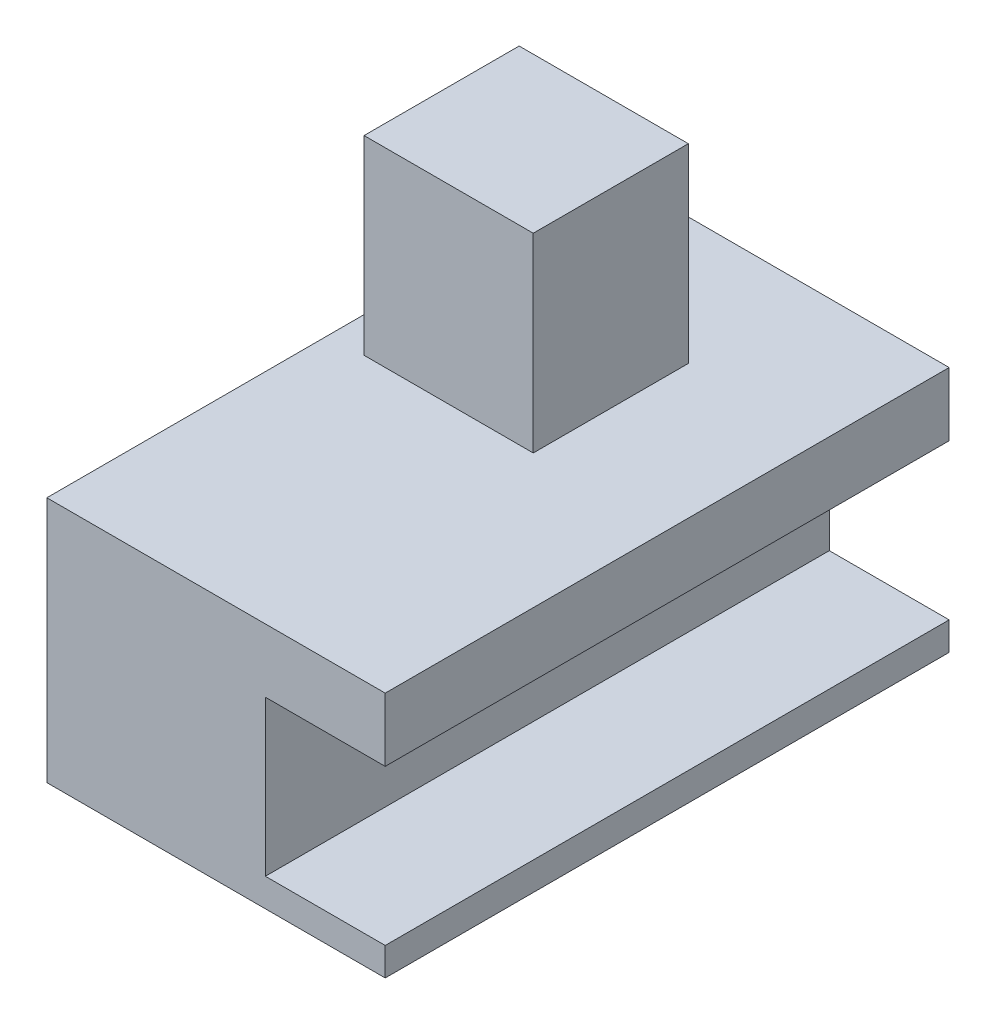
ISO-10303-21;
HEADER;
FILE_DESCRIPTION(('STEP AP214'),'2;1');
FILE_NAME('part.step','',(''),(''),'','','');
FILE_SCHEMA(('AUTOMOTIVE_DESIGN { 1 0 10303 214 1 1 1 1 }'));
ENDSEC;
DATA;
#1=APPLICATION_CONTEXT('core data for automotive mechanical design processes');
#2=APPLICATION_PROTOCOL_DEFINITION('international standard','automotive_design',2000,#1);
#3=PRODUCT_CONTEXT('',#1,'mechanical');
#4=PRODUCT('Part','Part','',(#3));
#5=PRODUCT_RELATED_PRODUCT_CATEGORY('part','',(#4));
#6=PRODUCT_DEFINITION_FORMATION('','',#4);
#7=PRODUCT_DEFINITION_CONTEXT('part definition',#1,'design');
#8=PRODUCT_DEFINITION('design','',#6,#7);
#9=PRODUCT_DEFINITION_SHAPE('','',#8);
#10=(LENGTH_UNIT() NAMED_UNIT(*) SI_UNIT(.MILLI.,.METRE.));
#11=(NAMED_UNIT(*) PLANE_ANGLE_UNIT() SI_UNIT($,.RADIAN.));
#12=(NAMED_UNIT(*) SI_UNIT($,.STERADIAN.) SOLID_ANGLE_UNIT());
#13=UNCERTAINTY_MEASURE_WITH_UNIT(LENGTH_MEASURE(1.E-05),#10,'distance_accuracy_value','');
#14=(GEOMETRIC_REPRESENTATION_CONTEXT(3) GLOBAL_UNCERTAINTY_ASSIGNED_CONTEXT((#13)) GLOBAL_UNIT_ASSIGNED_CONTEXT((#10,
#11,#12)) REPRESENTATION_CONTEXT('',''));
#15=CARTESIAN_POINT('',(0.,0.,0.));
#16=DIRECTION('',(0.,0.,1.));
#17=DIRECTION('',(1.,0.,0.));
#18=AXIS2_PLACEMENT_3D('',#15,#16,#17);
#19=CARTESIAN_POINT('',(0.,35.,-80.));
#20=DIRECTION('',(0.,1.,0.));
#21=DIRECTION('',(0.,0.,1.));
#22=AXIS2_PLACEMENT_3D('',#19,#20,#21);
#23=PLANE('',#22);
#24=DIRECTION('',(-1.,0.,0.));
#25=VECTOR('',#24,1.);
#26=CARTESIAN_POINT('',(0.,35.,0.));
#27=LINE('',#26,#25);
#28=CARTESIAN_POINT('',(48.,35.,0.));
#29=VERTEX_POINT('',#28);
#30=CARTESIAN_POINT('',(0.,35.,0.));
#31=VERTEX_POINT('',#30);
#32=EDGE_CURVE('E174',#29,#31,#27,.T.);
#33=ORIENTED_EDGE('',*,*,#32,.F.);
#34=DIRECTION('',(0.,0.,1.));
#35=VECTOR('',#34,1.);
#36=CARTESIAN_POINT('',(48.,35.,-80.));
#37=LINE('',#36,#35);
#38=CARTESIAN_POINT('',(48.,35.,-80.));
#39=VERTEX_POINT('',#38);
#40=EDGE_CURVE('E33',#39,#29,#37,.T.);
#41=ORIENTED_EDGE('',*,*,#40,.F.);
#42=DIRECTION('',(-1.,0.,0.));
#43=VECTOR('',#42,1.);
#44=CARTESIAN_POINT('',(0.,35.,-80.));
#45=LINE('',#44,#43);
#46=CARTESIAN_POINT('',(0.,35.,-80.));
#47=VERTEX_POINT('',#46);
#48=EDGE_CURVE('E197',#39,#47,#45,.T.);
#49=ORIENTED_EDGE('',*,*,#48,.T.);
#50=DIRECTION('',(0.,0.,1.));
#51=VECTOR('',#50,1.);
#52=CARTESIAN_POINT('',(0.,35.,-80.));
#53=LINE('',#52,#51);
#54=EDGE_CURVE('E11',#47,#31,#53,.T.);
#55=ORIENTED_EDGE('',*,*,#54,.T.);
#56=EDGE_LOOP('',(#33,#41,#49,#55));
#57=FACE_BOUND('',#56,.T.);
#58=DIRECTION('',(-1.,0.,0.));
#59=VECTOR('',#58,1.);
#60=CARTESIAN_POINT('',(29.,35.,-62.));
#61=LINE('',#60,#59);
#62=CARTESIAN_POINT('',(29.,35.,-62.));
#63=VERTEX_POINT('',#62);
#64=CARTESIAN_POINT('',(5.,35.,-62.));
#65=VERTEX_POINT('',#64);
#66=EDGE_CURVE('E119',#63,#65,#61,.T.);
#67=ORIENTED_EDGE('',*,*,#66,.F.);
#68=DIRECTION('',(0.,0.,-1.));
#69=VECTOR('',#68,1.);
#70=CARTESIAN_POINT('',(29.,35.,-62.));
#71=LINE('',#70,#69);
#72=CARTESIAN_POINT('',(29.,35.,-40.));
#73=VERTEX_POINT('',#72);
#74=EDGE_CURVE('E130',#73,#63,#71,.T.);
#75=ORIENTED_EDGE('',*,*,#74,.F.);
#76=DIRECTION('',(1.,0.,0.));
#77=VECTOR('',#76,1.);
#78=CARTESIAN_POINT('',(29.,35.,-40.));
#79=LINE('',#78,#77);
#80=CARTESIAN_POINT('',(5.,35.,-40.));
#81=VERTEX_POINT('',#80);
#82=EDGE_CURVE('E140',#81,#73,#79,.T.);
#83=ORIENTED_EDGE('',*,*,#82,.F.);
#84=DIRECTION('',(0.,0.,1.));
#85=VECTOR('',#84,1.);
#86=CARTESIAN_POINT('',(5.,35.,-62.));
#87=LINE('',#86,#85);
#88=EDGE_CURVE('E138',#65,#81,#87,.T.);
#89=ORIENTED_EDGE('',*,*,#88,.F.);
#90=EDGE_LOOP('',(#67,#75,#83,#89));
#91=FACE_BOUND('',#90,.T.);
#92=ADVANCED_FACE('F24',(#57,#91),#23,.T.);
#93=CARTESIAN_POINT('',(0.,0.,-80.));
#94=DIRECTION('',(-1.,0.,0.));
#95=DIRECTION('',(0.,0.,1.));
#96=AXIS2_PLACEMENT_3D('',#93,#94,#95);
#97=PLANE('',#96);
#98=DIRECTION('',(0.,-1.,0.));
#99=VECTOR('',#98,1.);
#100=CARTESIAN_POINT('',(0.,0.,0.));
#101=LINE('',#100,#99);
#102=CARTESIAN_POINT('',(0.,0.,0.));
#103=VERTEX_POINT('',#102);
#104=EDGE_CURVE('E125',#31,#103,#101,.T.);
#105=ORIENTED_EDGE('',*,*,#104,.F.);
#106=ORIENTED_EDGE('',*,*,#54,.F.);
#107=DIRECTION('',(0.,-1.,0.));
#108=VECTOR('',#107,1.);
#109=CARTESIAN_POINT('',(0.,0.,-80.));
#110=LINE('',#109,#108);
#111=CARTESIAN_POINT('',(0.,0.,-80.));
#112=VERTEX_POINT('',#111);
#113=EDGE_CURVE('E177',#47,#112,#110,.T.);
#114=ORIENTED_EDGE('',*,*,#113,.T.);
#115=DIRECTION('',(0.,0.,1.));
#116=VECTOR('',#115,1.);
#117=CARTESIAN_POINT('',(0.,0.,-80.));
#118=LINE('',#117,#116);
#119=EDGE_CURVE('E28',#112,#103,#118,.T.);
#120=ORIENTED_EDGE('',*,*,#119,.T.);
#121=EDGE_LOOP('',(#105,#106,#114,#120));
#122=FACE_BOUND('',#121,.T.);
#123=ADVANCED_FACE('F26',(#122),#97,.T.);
#124=CARTESIAN_POINT('',(48.,26.,-80.));
#125=DIRECTION('',(1.,0.,0.));
#126=DIRECTION('',(0.,0.,-1.));
#127=AXIS2_PLACEMENT_3D('',#124,#125,#126);
#128=PLANE('',#127);
#129=DIRECTION('',(0.,1.,0.));
#130=VECTOR('',#129,1.);
#131=CARTESIAN_POINT('',(48.,26.,0.));
#132=LINE('',#131,#130);
#133=CARTESIAN_POINT('',(48.,26.,0.));
#134=VERTEX_POINT('',#133);
#135=EDGE_CURVE('E171',#134,#29,#132,.T.);
#136=ORIENTED_EDGE('',*,*,#135,.F.);
#137=DIRECTION('',(0.,0.,1.));
#138=VECTOR('',#137,1.);
#139=CARTESIAN_POINT('',(48.,26.,-80.));
#140=LINE('',#139,#138);
#141=CARTESIAN_POINT('',(48.,26.,-80.));
#142=VERTEX_POINT('',#141);
#143=EDGE_CURVE('E201',#142,#134,#140,.T.);
#144=ORIENTED_EDGE('',*,*,#143,.F.);
#145=DIRECTION('',(0.,1.,0.));
#146=VECTOR('',#145,1.);
#147=CARTESIAN_POINT('',(48.,26.,-80.));
#148=LINE('',#147,#146);
#149=EDGE_CURVE('E194',#142,#39,#148,.T.);
#150=ORIENTED_EDGE('',*,*,#149,.T.);
#151=ORIENTED_EDGE('',*,*,#40,.T.);
#152=EDGE_LOOP('',(#136,#144,#150,#151));
#153=FACE_BOUND('',#152,.T.);
#154=ADVANCED_FACE('F239',(#153),#128,.T.);
#155=CARTESIAN_POINT('',(48.,26.,-80.));
#156=DIRECTION('',(0.,-1.,0.));
#157=DIRECTION('',(1.,0.,0.));
#158=AXIS2_PLACEMENT_3D('',#155,#156,#157);
#159=PLANE('',#158);
#160=DIRECTION('',(1.,0.,0.));
#161=VECTOR('',#160,1.);
#162=CARTESIAN_POINT('',(48.,26.,0.));
#163=LINE('',#162,#161);
#164=CARTESIAN_POINT('',(31.,26.,0.));
#165=VERTEX_POINT('',#164);
#166=EDGE_CURVE('E168',#165,#134,#163,.T.);
#167=ORIENTED_EDGE('',*,*,#166,.F.);
#168=DIRECTION('',(0.,0.,1.));
#169=VECTOR('',#168,1.);
#170=CARTESIAN_POINT('',(31.,26.,-80.));
#171=LINE('',#170,#169);
#172=CARTESIAN_POINT('',(31.,26.,-80.));
#173=VERTEX_POINT('',#172);
#174=EDGE_CURVE('E203',#173,#165,#171,.T.);
#175=ORIENTED_EDGE('',*,*,#174,.F.);
#176=DIRECTION('',(1.,0.,0.));
#177=VECTOR('',#176,1.);
#178=CARTESIAN_POINT('',(48.,26.,-80.));
#179=LINE('',#178,#177);
#180=EDGE_CURVE('E191',#173,#142,#179,.T.);
#181=ORIENTED_EDGE('',*,*,#180,.T.);
#182=ORIENTED_EDGE('',*,*,#143,.T.);
#183=EDGE_LOOP('',(#167,#175,#181,#182));
#184=FACE_BOUND('',#183,.T.);
#185=ADVANCED_FACE('F237',(#184),#159,.T.);
#186=CARTESIAN_POINT('',(31.,26.,-80.));
#187=DIRECTION('',(1.,0.,0.));
#188=DIRECTION('',(0.,1.,0.));
#189=AXIS2_PLACEMENT_3D('',#186,#187,#188);
#190=PLANE('',#189);
#191=DIRECTION('',(0.,1.,0.));
#192=VECTOR('',#191,1.);
#193=CARTESIAN_POINT('',(31.,26.,0.));
#194=LINE('',#193,#192);
#195=CARTESIAN_POINT('',(31.,4.,0.));
#196=VERTEX_POINT('',#195);
#197=EDGE_CURVE('E165',#196,#165,#194,.T.);
#198=ORIENTED_EDGE('',*,*,#197,.F.);
#199=DIRECTION('',(0.,0.,1.));
#200=VECTOR('',#199,1.);
#201=CARTESIAN_POINT('',(31.,4.,-80.));
#202=LINE('',#201,#200);
#203=CARTESIAN_POINT('',(31.,4.,-80.));
#204=VERTEX_POINT('',#203);
#205=EDGE_CURVE('E205',#204,#196,#202,.T.);
#206=ORIENTED_EDGE('',*,*,#205,.F.);
#207=DIRECTION('',(0.,1.,0.));
#208=VECTOR('',#207,1.);
#209=CARTESIAN_POINT('',(31.,26.,-80.));
#210=LINE('',#209,#208);
#211=EDGE_CURVE('E188',#204,#173,#210,.T.);
#212=ORIENTED_EDGE('',*,*,#211,.T.);
#213=ORIENTED_EDGE('',*,*,#174,.T.);
#214=EDGE_LOOP('',(#198,#206,#212,#213));
#215=FACE_BOUND('',#214,.T.);
#216=ADVANCED_FACE('F234',(#215),#190,.T.);
#217=CARTESIAN_POINT('',(31.,4.,-80.));
#218=DIRECTION('',(0.,1.,0.));
#219=DIRECTION('',(0.,0.,1.));
#220=AXIS2_PLACEMENT_3D('',#217,#218,#219);
#221=PLANE('',#220);
#222=DIRECTION('',(-1.,0.,0.));
#223=VECTOR('',#222,1.);
#224=CARTESIAN_POINT('',(31.,4.,0.));
#225=LINE('',#224,#223);
#226=CARTESIAN_POINT('',(48.,4.,0.));
#227=VERTEX_POINT('',#226);
#228=EDGE_CURVE('E162',#227,#196,#225,.T.);
#229=ORIENTED_EDGE('',*,*,#228,.F.);
#230=DIRECTION('',(0.,0.,1.));
#231=VECTOR('',#230,1.);
#232=CARTESIAN_POINT('',(48.,4.,-80.));
#233=LINE('',#232,#231);
#234=CARTESIAN_POINT('',(48.,4.,-80.));
#235=VERTEX_POINT('',#234);
#236=EDGE_CURVE('E207',#235,#227,#233,.T.);
#237=ORIENTED_EDGE('',*,*,#236,.F.);
#238=DIRECTION('',(-1.,0.,0.));
#239=VECTOR('',#238,1.);
#240=CARTESIAN_POINT('',(31.,4.,-80.));
#241=LINE('',#240,#239);
#242=EDGE_CURVE('E185',#235,#204,#241,.T.);
#243=ORIENTED_EDGE('',*,*,#242,.T.);
#244=ORIENTED_EDGE('',*,*,#205,.T.);
#245=EDGE_LOOP('',(#229,#237,#243,#244));
#246=FACE_BOUND('',#245,.T.);
#247=ADVANCED_FACE('F232',(#246),#221,.T.);
#248=CARTESIAN_POINT('',(48.,0.,-80.));
#249=DIRECTION('',(1.,0.,0.));
#250=DIRECTION('',(0.,0.,-1.));
#251=AXIS2_PLACEMENT_3D('',#248,#249,#250);
#252=PLANE('',#251);
#253=DIRECTION('',(0.,1.,0.));
#254=VECTOR('',#253,1.);
#255=CARTESIAN_POINT('',(48.,0.,0.));
#256=LINE('',#255,#254);
#257=CARTESIAN_POINT('',(48.,0.,0.));
#258=VERTEX_POINT('',#257);
#259=EDGE_CURVE('E159',#258,#227,#256,.T.);
#260=ORIENTED_EDGE('',*,*,#259,.F.);
#261=DIRECTION('',(0.,0.,1.));
#262=VECTOR('',#261,1.);
#263=CARTESIAN_POINT('',(48.,0.,-80.));
#264=LINE('',#263,#262);
#265=CARTESIAN_POINT('',(48.,0.,-80.));
#266=VERTEX_POINT('',#265);
#267=EDGE_CURVE('E208',#266,#258,#264,.T.);
#268=ORIENTED_EDGE('',*,*,#267,.F.);
#269=DIRECTION('',(0.,1.,0.));
#270=VECTOR('',#269,1.);
#271=CARTESIAN_POINT('',(48.,0.,-80.));
#272=LINE('',#271,#270);
#273=EDGE_CURVE('E182',#266,#235,#272,.T.);
#274=ORIENTED_EDGE('',*,*,#273,.T.);
#275=ORIENTED_EDGE('',*,*,#236,.T.);
#276=EDGE_LOOP('',(#260,#268,#274,#275));
#277=FACE_BOUND('',#276,.T.);
#278=ADVANCED_FACE('F228',(#277),#252,.T.);
#279=CARTESIAN_POINT('',(0.,0.,-80.));
#280=DIRECTION('',(0.,-1.,0.));
#281=DIRECTION('',(0.,0.,-1.));
#282=AXIS2_PLACEMENT_3D('',#279,#280,#281);
#283=PLANE('',#282);
#284=DIRECTION('',(1.,0.,0.));
#285=VECTOR('',#284,1.);
#286=CARTESIAN_POINT('',(0.,0.,0.));
#287=LINE('',#286,#285);
#288=EDGE_CURVE('E156',#103,#258,#287,.T.);
#289=ORIENTED_EDGE('',*,*,#288,.F.);
#290=ORIENTED_EDGE('',*,*,#119,.F.);
#291=DIRECTION('',(1.,0.,0.));
#292=VECTOR('',#291,1.);
#293=CARTESIAN_POINT('',(0.,0.,-80.));
#294=LINE('',#293,#292);
#295=EDGE_CURVE('E179',#112,#266,#294,.T.);
#296=ORIENTED_EDGE('',*,*,#295,.T.);
#297=ORIENTED_EDGE('',*,*,#267,.T.);
#298=EDGE_LOOP('',(#289,#290,#296,#297));
#299=FACE_BOUND('',#298,.T.);
#300=ADVANCED_FACE('F213',(#299),#283,.T.);
#301=CARTESIAN_POINT('',(0.,35.,-80.));
#302=DIRECTION('',(0.,0.,-1.));
#303=DIRECTION('',(-1.,0.,0.));
#304=AXIS2_PLACEMENT_3D('',#301,#302,#303);
#305=PLANE('',#304);
#306=ORIENTED_EDGE('',*,*,#113,.F.);
#307=ORIENTED_EDGE('',*,*,#48,.F.);
#308=ORIENTED_EDGE('',*,*,#149,.F.);
#309=ORIENTED_EDGE('',*,*,#180,.F.);
#310=ORIENTED_EDGE('',*,*,#211,.F.);
#311=ORIENTED_EDGE('',*,*,#242,.F.);
#312=ORIENTED_EDGE('',*,*,#273,.F.);
#313=ORIENTED_EDGE('',*,*,#295,.F.);
#314=EDGE_LOOP('',(#306,#307,#308,#309,#310,#311,#312,#313));
#315=FACE_BOUND('',#314,.T.);
#316=ADVANCED_FACE('F222',(#315),#305,.T.);
#317=CARTESIAN_POINT('',(0.,35.,0.));
#318=DIRECTION('',(0.,0.,-1.));
#319=DIRECTION('',(-1.,0.,0.));
#320=AXIS2_PLACEMENT_3D('',#317,#318,#319);
#321=PLANE('',#320);
#322=ORIENTED_EDGE('',*,*,#104,.T.);
#323=ORIENTED_EDGE('',*,*,#288,.T.);
#324=ORIENTED_EDGE('',*,*,#259,.T.);
#325=ORIENTED_EDGE('',*,*,#228,.T.);
#326=ORIENTED_EDGE('',*,*,#197,.T.);
#327=ORIENTED_EDGE('',*,*,#166,.T.);
#328=ORIENTED_EDGE('',*,*,#135,.T.);
#329=ORIENTED_EDGE('',*,*,#32,.T.);
#330=EDGE_LOOP('',(#322,#323,#324,#325,#326,#327,#328,#329));
#331=FACE_BOUND('',#330,.T.);
#332=ADVANCED_FACE('F215',(#331),#321,.F.);
#333=CARTESIAN_POINT('',(29.,62.,-62.));
#334=DIRECTION('',(-1.,0.,0.));
#335=DIRECTION('',(0.,0.,1.));
#336=AXIS2_PLACEMENT_3D('',#333,#334,#335);
#337=PLANE('',#336);
#338=ORIENTED_EDGE('',*,*,#74,.T.);
#339=DIRECTION('',(0.,-1.,0.));
#340=VECTOR('',#339,1.);
#341=CARTESIAN_POINT('',(29.,62.,-62.));
#342=LINE('',#341,#340);
#343=CARTESIAN_POINT('',(29.,62.,-62.));
#344=VERTEX_POINT('',#343);
#345=EDGE_CURVE('E114',#344,#63,#342,.T.);
#346=ORIENTED_EDGE('',*,*,#345,.F.);
#347=DIRECTION('',(0.,0.,-1.));
#348=VECTOR('',#347,1.);
#349=CARTESIAN_POINT('',(29.,62.,-62.));
#350=LINE('',#349,#348);
#351=CARTESIAN_POINT('',(29.,62.,-40.));
#352=VERTEX_POINT('',#351);
#353=EDGE_CURVE('E144',#352,#344,#350,.T.);
#354=ORIENTED_EDGE('',*,*,#353,.F.);
#355=DIRECTION('',(0.,-1.,0.));
#356=VECTOR('',#355,1.);
#357=CARTESIAN_POINT('',(29.,62.,-40.));
#358=LINE('',#357,#356);
#359=EDGE_CURVE('E133',#352,#73,#358,.T.);
#360=ORIENTED_EDGE('',*,*,#359,.T.);
#361=EDGE_LOOP('',(#338,#346,#354,#360));
#362=FACE_BOUND('',#361,.T.);
#363=ADVANCED_FACE('F131',(#362),#337,.F.);
#364=CARTESIAN_POINT('',(29.,62.,-62.));
#365=DIRECTION('',(0.,0.,1.));
#366=DIRECTION('',(1.,0.,0.));
#367=AXIS2_PLACEMENT_3D('',#364,#365,#366);
#368=PLANE('',#367);
#369=ORIENTED_EDGE('',*,*,#66,.T.);
#370=DIRECTION('',(0.,-1.,0.));
#371=VECTOR('',#370,1.);
#372=CARTESIAN_POINT('',(5.,62.,-62.));
#373=LINE('',#372,#371);
#374=CARTESIAN_POINT('',(5.,62.,-62.));
#375=VERTEX_POINT('',#374);
#376=EDGE_CURVE('E126',#375,#65,#373,.T.);
#377=ORIENTED_EDGE('',*,*,#376,.F.);
#378=DIRECTION('',(-1.,0.,0.));
#379=VECTOR('',#378,1.);
#380=CARTESIAN_POINT('',(29.,62.,-62.));
#381=LINE('',#380,#379);
#382=EDGE_CURVE('E121',#344,#375,#381,.T.);
#383=ORIENTED_EDGE('',*,*,#382,.F.);
#384=ORIENTED_EDGE('',*,*,#345,.T.);
#385=EDGE_LOOP('',(#369,#377,#383,#384));
#386=FACE_BOUND('',#385,.T.);
#387=ADVANCED_FACE('F116',(#386),#368,.F.);
#388=CARTESIAN_POINT('',(5.,62.,-62.));
#389=DIRECTION('',(1.,0.,0.));
#390=DIRECTION('',(0.,0.,-1.));
#391=AXIS2_PLACEMENT_3D('',#388,#389,#390);
#392=PLANE('',#391);
#393=ORIENTED_EDGE('',*,*,#88,.T.);
#394=DIRECTION('',(0.,-1.,0.));
#395=VECTOR('',#394,1.);
#396=CARTESIAN_POINT('',(5.,62.,-40.));
#397=LINE('',#396,#395);
#398=CARTESIAN_POINT('',(5.,62.,-40.));
#399=VERTEX_POINT('',#398);
#400=EDGE_CURVE('E41',#399,#81,#397,.T.);
#401=ORIENTED_EDGE('',*,*,#400,.F.);
#402=DIRECTION('',(0.,0.,1.));
#403=VECTOR('',#402,1.);
#404=CARTESIAN_POINT('',(5.,62.,-62.));
#405=LINE('',#404,#403);
#406=EDGE_CURVE('E147',#375,#399,#405,.T.);
#407=ORIENTED_EDGE('',*,*,#406,.F.);
#408=ORIENTED_EDGE('',*,*,#376,.T.);
#409=EDGE_LOOP('',(#393,#401,#407,#408));
#410=FACE_BOUND('',#409,.T.);
#411=ADVANCED_FACE('F260',(#410),#392,.F.);
#412=CARTESIAN_POINT('',(29.,62.,-40.));
#413=DIRECTION('',(0.,0.,-1.));
#414=DIRECTION('',(-1.,0.,0.));
#415=AXIS2_PLACEMENT_3D('',#412,#413,#414);
#416=PLANE('',#415);
#417=ORIENTED_EDGE('',*,*,#82,.T.);
#418=ORIENTED_EDGE('',*,*,#359,.F.);
#419=DIRECTION('',(1.,0.,0.));
#420=VECTOR('',#419,1.);
#421=CARTESIAN_POINT('',(29.,62.,-40.));
#422=LINE('',#421,#420);
#423=EDGE_CURVE('E149',#399,#352,#422,.T.);
#424=ORIENTED_EDGE('',*,*,#423,.F.);
#425=ORIENTED_EDGE('',*,*,#400,.T.);
#426=EDGE_LOOP('',(#417,#418,#424,#425));
#427=FACE_BOUND('',#426,.T.);
#428=ADVANCED_FACE('F263',(#427),#416,.F.);
#429=CARTESIAN_POINT('',(29.,62.,-40.));
#430=DIRECTION('',(0.,-1.,0.));
#431=DIRECTION('',(0.,0.,-1.));
#432=AXIS2_PLACEMENT_3D('',#429,#430,#431);
#433=PLANE('',#432);
#434=ORIENTED_EDGE('',*,*,#353,.T.);
#435=ORIENTED_EDGE('',*,*,#382,.T.);
#436=ORIENTED_EDGE('',*,*,#406,.T.);
#437=ORIENTED_EDGE('',*,*,#423,.T.);
#438=EDGE_LOOP('',(#434,#435,#436,#437));
#439=FACE_BOUND('',#438,.T.);
#440=ADVANCED_FACE('F267',(#439),#433,.F.);
#441=CLOSED_SHELL('',(#92,#123,#154,#185,#216,#247,#278,#300,#316,#332,#363,#387,#411,#428,#440));
#442=MANIFOLD_SOLID_BREP('B2',#441);
#443=ADVANCED_BREP_SHAPE_REPRESENTATION('',(#18,#442),#14);
#444=SHAPE_DEFINITION_REPRESENTATION(#9,#443);
ENDSEC;
END-ISO-10303-21;
